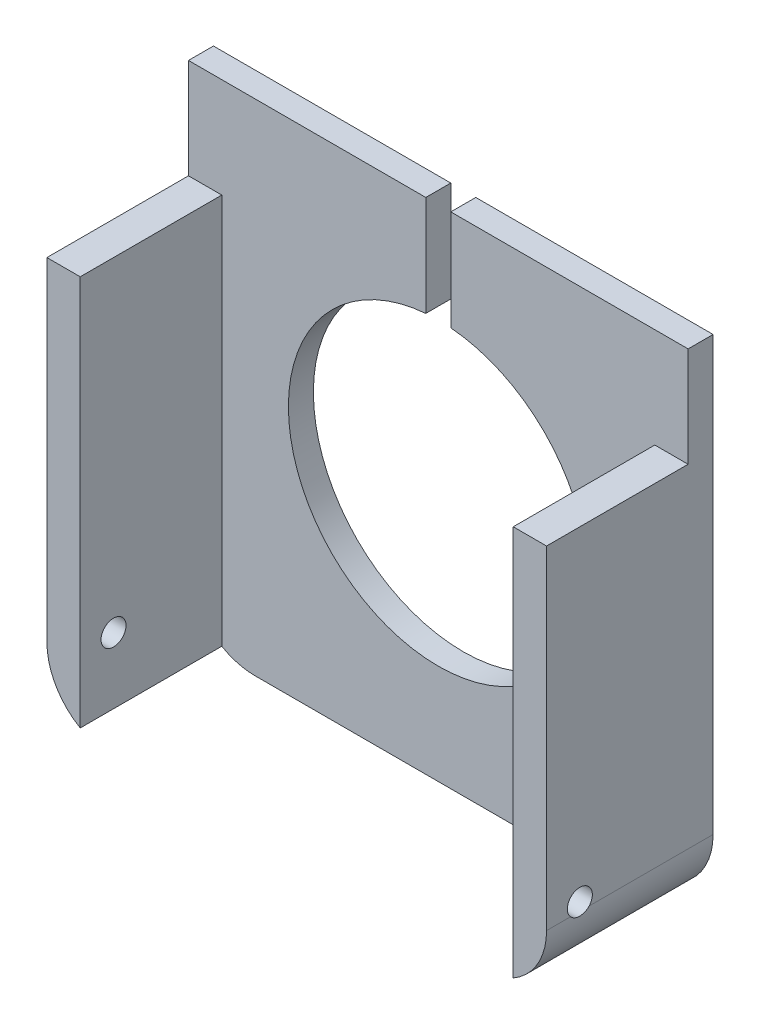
from build123d import *

# Parameters (mm, degrees)
SKIZZE1_W                       = 30
SKIZZE1_H                       = 30
AUFSATZ_LINEAR_AUSTRAGEN1_DEPTH = 10
SCHNITT_LINEAR_AUSTRAGEN1_DEPTH = 8.5
VERRUNDUNG1_R                   = 4
SKIZZE3_R                       = 9
SCHNITT_LINEAR_AUSTRAGEN2_DEPTH = 24.452078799
SKIZZE4_W                       = 1.5
SKIZZE4_H                       = 7.009868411
SCHNITT_LINEAR_AUSTRAGEN3_DEPTH = 24.452078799
SKIZZE5_R                       = 0.75
SCHNITT_LINEAR_AUSTRAGEN4_DEPTH = 36


with BuildPart() as part:
    # Skizze1 → Aufsatz-Linear austragen1 (new body)
    with BuildSketch(Plane.XY):
        Rectangle(SKIZZE1_W, SKIZZE1_H)
    extrude(amount=-AUFSATZ_LINEAR_AUSTRAGEN1_DEPTH)

    # Skizze2 → Schnitt-Linear austragen1 (cut)
    with BuildSketch(Plane.XY):
        Polygon((-19.532174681, 9), (-13, 9), (-13, -16.278866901), (13, -16.278866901), (13, 9), (17.263103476, 9), (17.263103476, 15.497794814), (-19.532174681, 15.497794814), align=None)
    extrude(amount=-SCHNITT_LINEAR_AUSTRAGEN1_DEPTH, mode=Mode.SUBTRACT)

    # Verrundung1
    verrundung1_edges = [part.edges().sort_by_distance(p)[0] for p in [
        (15, -15, -5),
        (-15, -15, -5),
    ]]
    fillet(verrundung1_edges, radius=VERRUNDUNG1_R)

    # Skizze3 → Schnitt-Linear austragen2 (cut, through all)
    with BuildSketch(Plane(origin=(0, 0, -10), x_dir=(-1, 0, 0), z_dir=(0, 0, -1))):
        Circle(SKIZZE3_R)
    extrude(amount=-SCHNITT_LINEAR_AUSTRAGEN2_DEPTH, mode=Mode.SUBTRACT)

    # Skizze4 → Schnitt-Linear austragen3 (cut, through all)
    with BuildSketch(Plane(origin=(0, 0, -10), x_dir=(-1, 0, 0), z_dir=(0, 0, -1))):
        with Locations((0, 11.908201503)):
            Rectangle(SKIZZE4_W, SKIZZE4_H)
    extrude(amount=-SCHNITT_LINEAR_AUSTRAGEN3_DEPTH, mode=Mode.SUBTRACT)

    # Skizze5 → Schnitt-Linear austragen4 (cut, through all)
    with BuildSketch(Plane(origin=(15, 0, 0), x_dir=(0, 0, -1), z_dir=(1, 0, 0))):
        with Locations(Location((2, -10.5, 0), (0, 0, 318.189685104))):
            Circle(SKIZZE5_R)
    extrude(amount=-SCHNITT_LINEAR_AUSTRAGEN4_DEPTH, mode=Mode.SUBTRACT)


solid = part.part
